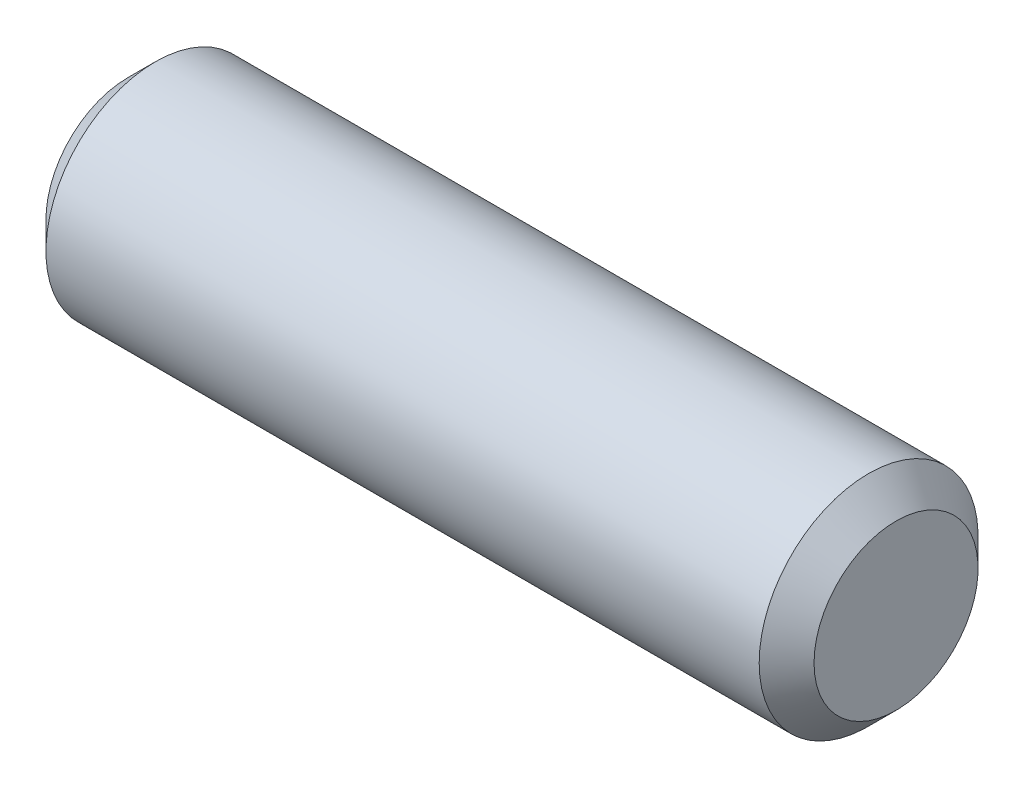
ISO-10303-21;
HEADER;
FILE_DESCRIPTION(('STEP AP214'),'2;1');
FILE_NAME('part.step','',(''),(''),'','','');
FILE_SCHEMA(('AUTOMOTIVE_DESIGN { 1 0 10303 214 1 1 1 1 }'));
ENDSEC;
DATA;
#1=APPLICATION_CONTEXT('core data for automotive mechanical design processes');
#2=APPLICATION_PROTOCOL_DEFINITION('international standard','automotive_design',2000,#1);
#3=PRODUCT_CONTEXT('',#1,'mechanical');
#4=PRODUCT('Part','Part','',(#3));
#5=PRODUCT_RELATED_PRODUCT_CATEGORY('part','',(#4));
#6=PRODUCT_DEFINITION_FORMATION('','',#4);
#7=PRODUCT_DEFINITION_CONTEXT('part definition',#1,'design');
#8=PRODUCT_DEFINITION('design','',#6,#7);
#9=PRODUCT_DEFINITION_SHAPE('','',#8);
#10=(LENGTH_UNIT() NAMED_UNIT(*) SI_UNIT(.MILLI.,.METRE.));
#11=(NAMED_UNIT(*) PLANE_ANGLE_UNIT() SI_UNIT($,.RADIAN.));
#12=(NAMED_UNIT(*) SI_UNIT($,.STERADIAN.) SOLID_ANGLE_UNIT());
#13=UNCERTAINTY_MEASURE_WITH_UNIT(LENGTH_MEASURE(1.E-05),#10,'distance_accuracy_value','');
#14=(GEOMETRIC_REPRESENTATION_CONTEXT(3) GLOBAL_UNCERTAINTY_ASSIGNED_CONTEXT((#13)) GLOBAL_UNIT_ASSIGNED_CONTEXT((#10,
#11,#12)) REPRESENTATION_CONTEXT('',''));
#15=CARTESIAN_POINT('',(0.,0.,0.));
#16=DIRECTION('',(0.,0.,1.));
#17=DIRECTION('',(1.,0.,0.));
#18=AXIS2_PLACEMENT_3D('',#15,#16,#17);
#19=CARTESIAN_POINT('',(14.,0.747500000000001,0.));
#20=DIRECTION('',(1.,0.,0.));
#21=DIRECTION('',(0.,0.,-1.));
#22=AXIS2_PLACEMENT_3D('',#19,#20,#21);
#23=PLANE('',#22);
#24=CARTESIAN_POINT('',(14.0000000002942,0.,0.));
#25=DIRECTION('',(-1.,0.,0.));
#26=DIRECTION('',(0.,0.,1.));
#27=AXIS2_PLACEMENT_3D('',#24,#25,#26);
#28=CIRCLE('',#27,1.49500000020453);
#29=CARTESIAN_POINT('',(14.0000000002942,0.,1.49500000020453));
#30=VERTEX_POINT('',#29);
#31=EDGE_CURVE('E18',#30,#30,#28,.T.);
#32=ORIENTED_EDGE('',*,*,#31,.F.);
#33=EDGE_LOOP('',(#32));
#34=FACE_BOUND('',#33,.T.);
#35=ADVANCED_FACE('F15',(#34),#23,.T.);
#36=CARTESIAN_POINT('',(0.,0.747499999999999,0.));
#37=DIRECTION('',(-1.,0.,0.));
#38=DIRECTION('',(0.,0.,1.));
#39=AXIS2_PLACEMENT_3D('',#36,#37,#38);
#40=PLANE('',#39);
#41=CARTESIAN_POINT('',(-2.84216877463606E-10,0.,0.));
#42=DIRECTION('',(1.,0.,0.));
#43=DIRECTION('',(0.,1.,0.));
#44=AXIS2_PLACEMENT_3D('',#41,#42,#43);
#45=CIRCLE('',#44,1.49500000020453);
#46=CARTESIAN_POINT('',(-2.84217121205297E-10,1.49500000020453,0.));
#47=VERTEX_POINT('',#46);
#48=EDGE_CURVE('E27',#47,#47,#45,.T.);
#49=ORIENTED_EDGE('',*,*,#48,.F.);
#50=EDGE_LOOP('',(#49));
#51=FACE_BOUND('',#50,.T.);
#52=ADVANCED_FACE('F42',(#51),#40,.T.);
#53=CARTESIAN_POINT('',(13.4999999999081,0.,0.));
#54=DIRECTION('',(-1.,0.,0.));
#55=DIRECTION('',(0.,0.,1.));
#56=AXIS2_PLACEMENT_3D('',#53,#54,#55);
#57=CONICAL_SURFACE('',#56,1.99499999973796,0.785398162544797);
#58=CARTESIAN_POINT('',(13.5,0.,0.));
#59=DIRECTION('',(1.,0.,0.));
#60=DIRECTION('',(0.,1.,0.));
#61=AXIS2_PLACEMENT_3D('',#58,#59,#60);
#62=CIRCLE('',#61,1.995);
#63=CARTESIAN_POINT('',(13.5,1.995,0.));
#64=VERTEX_POINT('',#63);
#65=EDGE_CURVE('E22',#64,#64,#62,.F.);
#66=ORIENTED_EDGE('',*,*,#65,.F.);
#67=EDGE_LOOP('',(#66));
#68=FACE_BOUND('',#67,.T.);
#69=ORIENTED_EDGE('',*,*,#31,.T.);
#70=EDGE_LOOP('',(#69));
#71=FACE_BOUND('',#70,.T.);
#72=ADVANCED_FACE('F39',(#68,#71),#57,.T.);
#73=CARTESIAN_POINT('',(0.500000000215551,0.,0.));
#74=DIRECTION('',(1.,0.,0.));
#75=DIRECTION('',(0.,1.,0.));
#76=AXIS2_PLACEMENT_3D('',#73,#74,#75);
#77=CONICAL_SURFACE('',#76,1.99499999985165,0.785398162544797);
#78=ORIENTED_EDGE('',*,*,#48,.T.);
#79=EDGE_LOOP('',(#78));
#80=FACE_BOUND('',#79,.T.);
#81=CARTESIAN_POINT('',(0.5,0.,0.));
#82=DIRECTION('',(1.,0.,0.));
#83=DIRECTION('',(0.,1.,0.));
#84=AXIS2_PLACEMENT_3D('',#81,#82,#83);
#85=CIRCLE('',#84,1.995);
#86=CARTESIAN_POINT('',(0.5,1.995,0.));
#87=VERTEX_POINT('',#86);
#88=EDGE_CURVE('E10',#87,#87,#85,.T.);
#89=ORIENTED_EDGE('',*,*,#88,.F.);
#90=EDGE_LOOP('',(#89));
#91=FACE_BOUND('',#90,.T.);
#92=ADVANCED_FACE('F50',(#80,#91),#77,.T.);
#93=CARTESIAN_POINT('',(7.,0.,0.));
#94=DIRECTION('',(1.,0.,0.));
#95=DIRECTION('',(0.,1.,0.));
#96=AXIS2_PLACEMENT_3D('',#93,#94,#95);
#97=CYLINDRICAL_SURFACE('',#96,1.995);
#98=ORIENTED_EDGE('',*,*,#88,.T.);
#99=EDGE_LOOP('',(#98));
#100=FACE_BOUND('',#99,.T.);
#101=ORIENTED_EDGE('',*,*,#65,.T.);
#102=EDGE_LOOP('',(#101));
#103=FACE_BOUND('',#102,.T.);
#104=ADVANCED_FACE('F48',(#100,#103),#97,.T.);
#105=CLOSED_SHELL('',(#35,#52,#72,#92,#104));
#106=MANIFOLD_SOLID_BREP('B1',#105);
#107=ADVANCED_BREP_SHAPE_REPRESENTATION('',(#18,#106),#14);
#108=SHAPE_DEFINITION_REPRESENTATION(#9,#107);
ENDSEC;
END-ISO-10303-21;
